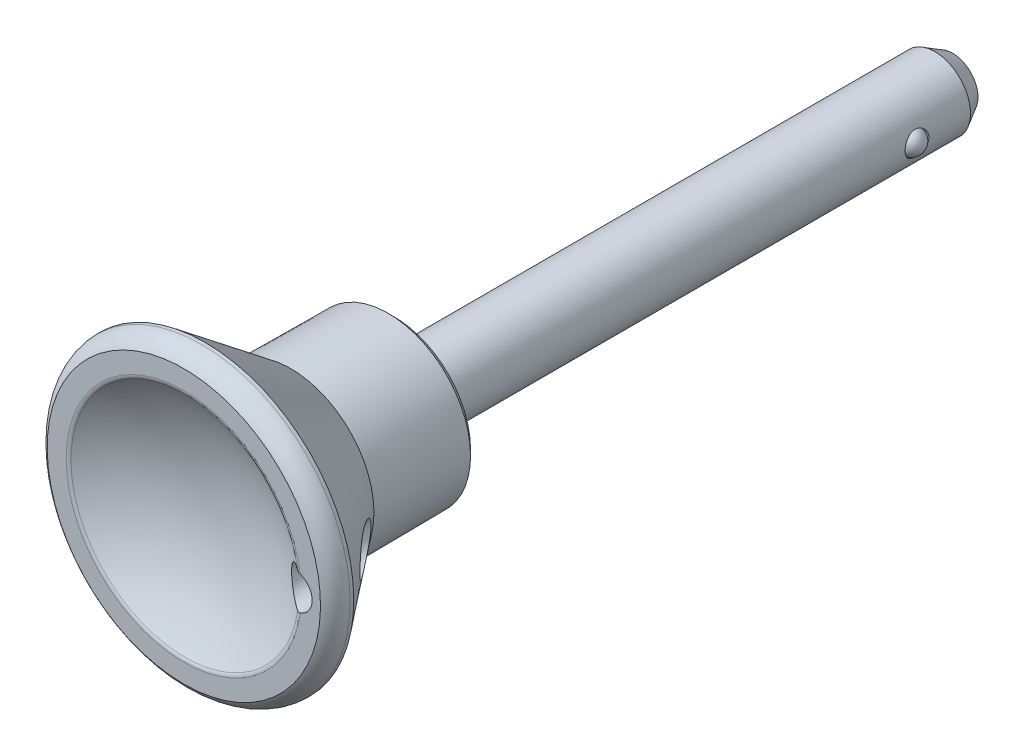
ISO-10303-21;
HEADER;
FILE_DESCRIPTION(('STEP AP214'),'2;1');
FILE_NAME('part.step','',(''),(''),'','','');
FILE_SCHEMA(('AUTOMOTIVE_DESIGN { 1 0 10303 214 1 1 1 1 }'));
ENDSEC;
DATA;
#1=APPLICATION_CONTEXT('core data for automotive mechanical design processes');
#2=APPLICATION_PROTOCOL_DEFINITION('international standard','automotive_design',2000,#1);
#3=PRODUCT_CONTEXT('',#1,'mechanical');
#4=PRODUCT('Part','Part','',(#3));
#5=PRODUCT_RELATED_PRODUCT_CATEGORY('part','',(#4));
#6=PRODUCT_DEFINITION_FORMATION('','',#4);
#7=PRODUCT_DEFINITION_CONTEXT('part definition',#1,'design');
#8=PRODUCT_DEFINITION('design','',#6,#7);
#9=PRODUCT_DEFINITION_SHAPE('','',#8);
#10=(LENGTH_UNIT() NAMED_UNIT(*) SI_UNIT(.MILLI.,.METRE.));
#11=(NAMED_UNIT(*) PLANE_ANGLE_UNIT() SI_UNIT($,.RADIAN.));
#12=(NAMED_UNIT(*) SI_UNIT($,.STERADIAN.) SOLID_ANGLE_UNIT());
#13=UNCERTAINTY_MEASURE_WITH_UNIT(LENGTH_MEASURE(1.E-05),#10,'distance_accuracy_value','');
#14=(GEOMETRIC_REPRESENTATION_CONTEXT(3) GLOBAL_UNCERTAINTY_ASSIGNED_CONTEXT((#13)) GLOBAL_UNIT_ASSIGNED_CONTEXT((#10,
#11,#12)) REPRESENTATION_CONTEXT('',''));
#15=CARTESIAN_POINT('',(0.,0.,0.));
#16=DIRECTION('',(0.,0.,1.));
#17=DIRECTION('',(1.,0.,0.));
#18=AXIS2_PLACEMENT_3D('',#15,#16,#17);
#19=CARTESIAN_POINT('',(0.,0.,0.));
#20=DIRECTION('',(0.,0.,1.));
#21=DIRECTION('',(0.,-1.,0.));
#22=AXIS2_PLACEMENT_3D('',#19,#20,#21);
#23=CYLINDRICAL_SURFACE('',#22,3.);
#24=CARTESIAN_POINT('',(0.,0.,0.));
#25=DIRECTION('',(0.,0.,1.));
#26=DIRECTION('',(0.,-1.,0.));
#27=AXIS2_PLACEMENT_3D('',#24,#25,#26);
#28=CIRCLE('',#27,3.);
#29=CARTESIAN_POINT('',(0.,-3.,0.));
#30=VERTEX_POINT('',#29);
#31=EDGE_CURVE('E17',#30,#30,#28,.T.);
#32=ORIENTED_EDGE('',*,*,#31,.F.);
#33=EDGE_LOOP('',(#32));
#34=FACE_BOUND('',#33,.T.);
#35=CARTESIAN_POINT('',(0.,0.,-45.5));
#36=DIRECTION('',(0.,0.,1.));
#37=DIRECTION('',(1.,0.,0.));
#38=AXIS2_PLACEMENT_3D('',#35,#36,#37);
#39=CIRCLE('',#38,3.);
#40=CARTESIAN_POINT('',(3.,0.,-45.5));
#41=VERTEX_POINT('',#40);
#42=EDGE_CURVE('E106',#41,#41,#39,.T.);
#43=ORIENTED_EDGE('',*,*,#42,.T.);
#44=EDGE_LOOP('',(#43));
#45=FACE_BOUND('',#44,.T.);
#46=CARTESIAN_POINT('',(3.,0.,-42.));
#47=CARTESIAN_POINT('',(2.99999782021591,-0.0544873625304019,-41.9999969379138));
#48=CARTESIAN_POINT('',(2.99849945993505,-0.109030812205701,-41.9955259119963));
#49=CARTESIAN_POINT('',(2.99265949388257,-0.216567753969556,-41.9777925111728));
#50=CARTESIAN_POINT('',(2.98831315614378,-0.269558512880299,-41.9645155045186));
#51=CARTESIAN_POINT('',(2.9772520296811,-0.372338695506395,-41.9296777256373));
#52=CARTESIAN_POINT('',(2.97054267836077,-0.422135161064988,-41.9081359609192));
#53=CARTESIAN_POINT('',(2.95544181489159,-0.517390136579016,-41.8574495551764));
#54=CARTESIAN_POINT('',(2.94705050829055,-0.56284917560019,-41.8283058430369));
#55=CARTESIAN_POINT('',(2.9291411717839,-0.649740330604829,-41.7621750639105));
#56=CARTESIAN_POINT('',(2.91959606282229,-0.691001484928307,-41.7249707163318));
#57=CARTESIAN_POINT('',(2.90060364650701,-0.766830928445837,-41.6442351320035));
#58=CARTESIAN_POINT('',(2.89115636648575,-0.801397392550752,-41.6007021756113));
#59=CARTESIAN_POINT('',(2.87313330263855,-0.863825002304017,-41.5070147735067));
#60=CARTESIAN_POINT('',(2.86459035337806,-0.89146498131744,-41.4567060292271));
#61=CARTESIAN_POINT('',(2.84975302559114,-0.937818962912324,-41.3518236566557));
#62=CARTESIAN_POINT('',(2.84345795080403,-0.956535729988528,-41.2972513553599));
#63=CARTESIAN_POINT('',(2.834113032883,-0.983873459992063,-41.187326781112));
#64=CARTESIAN_POINT('',(2.83096095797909,-0.992813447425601,-41.1320627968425));
#65=CARTESIAN_POINT('',(2.82795656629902,-1.00134112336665,-41.020736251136));
#66=CARTESIAN_POINT('',(2.82810323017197,-1.0009317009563,-40.9646739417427));
#67=CARTESIAN_POINT('',(2.83159014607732,-0.991019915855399,-40.8560634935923));
#68=CARTESIAN_POINT('',(2.83478414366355,-0.981933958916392,-40.8034718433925));
#69=CARTESIAN_POINT('',(2.84376655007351,-0.955606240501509,-40.7006068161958));
#70=CARTESIAN_POINT('',(2.84955528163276,-0.938363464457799,-40.650333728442));
#71=CARTESIAN_POINT('',(2.8631792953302,-0.895938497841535,-40.5525859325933));
#72=CARTESIAN_POINT('',(2.87104608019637,-0.870632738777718,-40.5051694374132));
#73=CARTESIAN_POINT('',(2.88792606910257,-0.812887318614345,-40.4151267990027));
#74=CARTESIAN_POINT('',(2.89693954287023,-0.780445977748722,-40.3725017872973));
#75=CARTESIAN_POINT('',(2.91567165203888,-0.707355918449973,-40.2909155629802));
#76=CARTESIAN_POINT('',(2.92540257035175,-0.666367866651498,-40.2522605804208));
#77=CARTESIAN_POINT('',(2.94406631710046,-0.578354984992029,-40.1822794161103));
#78=CARTESIAN_POINT('',(2.95299879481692,-0.531327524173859,-40.1509564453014));
#79=CARTESIAN_POINT('',(2.96917806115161,-0.431907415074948,-40.0962803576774));
#80=CARTESIAN_POINT('',(2.97640595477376,-0.379463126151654,-40.073015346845));
#81=CARTESIAN_POINT('',(2.98821351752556,-0.27116320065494,-40.0357719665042));
#82=CARTESIAN_POINT('',(2.99279860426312,-0.215314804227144,-40.0217745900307));
#83=CARTESIAN_POINT('',(2.99719039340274,-0.13245787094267,-40.0084544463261));
#84=CARTESIAN_POINT('',(2.99824082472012,-0.106081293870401,-40.0052879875));
#85=CARTESIAN_POINT('',(2.9996461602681,-0.0531409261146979,-40.0010600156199));
#86=CARTESIAN_POINT('',(3.00000106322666,-0.0265771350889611,-39.9999985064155));
#87=CARTESIAN_POINT('',(2.99999782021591,0.0544873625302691,-40.0000030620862));
#88=CARTESIAN_POINT('',(2.99849945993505,0.109030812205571,-40.0044740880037));
#89=CARTESIAN_POINT('',(2.99265949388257,0.216567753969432,-40.0222074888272));
#90=CARTESIAN_POINT('',(2.98831315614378,0.269558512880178,-40.0354844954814));
#91=CARTESIAN_POINT('',(2.9772520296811,0.372338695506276,-40.0703222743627));
#92=CARTESIAN_POINT('',(2.97054267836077,0.422135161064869,-40.0918640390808));
#93=CARTESIAN_POINT('',(2.95544181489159,0.517390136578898,-40.1425504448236));
#94=CARTESIAN_POINT('',(2.94705050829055,0.562849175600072,-40.1716941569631));
#95=CARTESIAN_POINT('',(2.9291411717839,0.64974033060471,-40.2378249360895));
#96=CARTESIAN_POINT('',(2.91959606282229,0.691001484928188,-40.2750292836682));
#97=CARTESIAN_POINT('',(2.90060364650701,0.766830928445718,-40.3557648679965));
#98=CARTESIAN_POINT('',(2.89115636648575,0.801397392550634,-40.3992978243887));
#99=CARTESIAN_POINT('',(2.87313330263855,0.863825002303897,-40.4929852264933));
#100=CARTESIAN_POINT('',(2.86459035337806,0.891464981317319,-40.5432939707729));
#101=CARTESIAN_POINT('',(2.84975302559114,0.937818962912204,-40.6481763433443));
#102=CARTESIAN_POINT('',(2.84345795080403,0.95653572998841,-40.7027486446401));
#103=CARTESIAN_POINT('',(2.834113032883,0.983873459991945,-40.812673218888));
#104=CARTESIAN_POINT('',(2.83096095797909,0.992813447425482,-40.8679372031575));
#105=CARTESIAN_POINT('',(2.82795656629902,1.00134112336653,-40.979263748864));
#106=CARTESIAN_POINT('',(2.82810323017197,1.00093170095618,-41.0353260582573));
#107=CARTESIAN_POINT('',(2.83159014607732,0.991019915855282,-41.1439365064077));
#108=CARTESIAN_POINT('',(2.83478414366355,0.981933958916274,-41.1965281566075));
#109=CARTESIAN_POINT('',(2.84376655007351,0.955606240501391,-41.2993931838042));
#110=CARTESIAN_POINT('',(2.84955528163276,0.938363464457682,-41.349666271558));
#111=CARTESIAN_POINT('',(2.86317929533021,0.895938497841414,-41.4474140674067));
#112=CARTESIAN_POINT('',(2.87104608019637,0.870632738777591,-41.4948305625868));
#113=CARTESIAN_POINT('',(2.88792606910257,0.812887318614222,-41.5848732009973));
#114=CARTESIAN_POINT('',(2.89693954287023,0.780445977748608,-41.6274982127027));
#115=CARTESIAN_POINT('',(2.91567165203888,0.707355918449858,-41.7090844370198));
#116=CARTESIAN_POINT('',(2.92540257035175,0.666367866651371,-41.7477394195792));
#117=CARTESIAN_POINT('',(2.94406631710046,0.578354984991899,-41.8177205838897));
#118=CARTESIAN_POINT('',(2.95299879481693,0.531327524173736,-41.8490435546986));
#119=CARTESIAN_POINT('',(2.96917806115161,0.43190741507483,-41.9037196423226));
#120=CARTESIAN_POINT('',(2.97640595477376,0.379463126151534,-41.926984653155));
#121=CARTESIAN_POINT('',(2.98821351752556,0.271163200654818,-41.9642280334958));
#122=CARTESIAN_POINT('',(2.99279860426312,0.215314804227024,-41.9782254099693));
#123=CARTESIAN_POINT('',(2.99719039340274,0.132457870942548,-41.9915455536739));
#124=CARTESIAN_POINT('',(2.99824082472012,0.106081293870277,-41.9947120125));
#125=CARTESIAN_POINT('',(2.9996461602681,0.0531409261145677,-41.9989399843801));
#126=CARTESIAN_POINT('',(3.00000106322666,0.0265771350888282,-42.0000014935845));
#127=CARTESIAN_POINT('',(3.,0.,-42.));
#128=B_SPLINE_CURVE_WITH_KNOTS('',3,(#46,#47,#48,#49,#50,#51,#52,#53,#54,#55,#56,#57,#58,#59,
#60,#61,#62,#63,#64,#65,#66,#67,#68,#69,#70,#71,#72,#73,#74,#75,#76,#77,#78,#79,#80,#81,#82,#83,
#84,#85,#86,#87,#88,#89,#90,#91,#92,#93,#94,#95,#96,#97,#98,#99,#100,#101,#102,#103,#104,#105,
#106,#107,#108,#109,#110,#111,#112,#113,#114,#115,#116,#117,#118,#119,#120,#121,#122,#123,#124,
#125,#126,#127),.UNSPECIFIED.,.T.,.F.,(4,2,2,2,2,2,2,2,2,2,2,2,2,2,2,2,2,2,2,2,2,2,2,2,2,2,2,2,
2,2,2,2,2,2,2,2,2,2,2,2,4),(0.,0.163359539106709,0.326991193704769,0.490248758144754,
0.653486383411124,0.821842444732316,0.990244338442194,1.16348424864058,1.3366704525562,
1.50401925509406,1.67131634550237,1.8309678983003,1.99063931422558,2.15288605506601,
2.31517103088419,2.48590393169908,2.65671146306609,2.82933165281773,3.00159671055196,
3.08127795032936,3.16095933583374,3.32431887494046,3.48795052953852,3.65120809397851,
3.81444571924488,3.98280178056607,4.15120367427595,4.32444358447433,4.49762978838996,
4.66497859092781,4.83227568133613,4.99192723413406,5.15159865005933,5.31384539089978,
5.47613036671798,5.64686326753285,5.81767079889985,5.9902909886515,6.16255604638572,
6.24223728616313,6.32191867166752),.UNSPECIFIED.);
#129=CARTESIAN_POINT('',(3.,0.,-42.));
#130=VERTEX_POINT('',#129);
#131=EDGE_CURVE('E142',#130,#130,#128,.T.);
#132=ORIENTED_EDGE('',*,*,#131,.T.);
#133=EDGE_LOOP('',(#132));
#134=FACE_BOUND('',#133,.T.);
#135=ADVANCED_FACE('F14',(#34,#45,#134),#23,.T.);
#136=CARTESIAN_POINT('',(6.4240762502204,-6.50116727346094,0.));
#137=DIRECTION('',(0.,0.,-1.));
#138=DIRECTION('',(-1.,0.,0.));
#139=AXIS2_PLACEMENT_3D('',#136,#137,#138);
#140=PLANE('',#139);
#141=ORIENTED_EDGE('',*,*,#31,.T.);
#142=EDGE_LOOP('',(#141));
#143=FACE_BOUND('',#142,.T.);
#144=CARTESIAN_POINT('',(0.,0.,0.));
#145=DIRECTION('',(0.,0.,1.));
#146=DIRECTION('',(0.,-1.,0.));
#147=AXIS2_PLACEMENT_3D('',#144,#145,#146);
#148=CIRCLE('',#147,6.4240762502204);
#149=CARTESIAN_POINT('',(0.,-6.4240762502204,0.));
#150=VERTEX_POINT('',#149);
#151=EDGE_CURVE('E94',#150,#150,#148,.T.);
#152=ORIENTED_EDGE('',*,*,#151,.F.);
#153=EDGE_LOOP('',(#152));
#154=FACE_BOUND('',#153,.T.);
#155=ADVANCED_FACE('F166',(#143,#154),#140,.T.);
#156=CARTESIAN_POINT('',(0.,0.,0.));
#157=DIRECTION('',(0.,0.,1.));
#158=DIRECTION('',(0.,-1.,0.));
#159=AXIS2_PLACEMENT_3D('',#156,#157,#158);
#160=CONICAL_SURFACE('',#159,6.4240762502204,0.789761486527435);
#161=CARTESIAN_POINT('',(0.,0.,0.499980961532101));
#162=DIRECTION('',(0.,0.,-1.));
#163=DIRECTION('',(1.,0.,0.));
#164=AXIS2_PLACEMENT_3D('',#161,#162,#163);
#165=CIRCLE('',#164,6.92843951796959);
#166=CARTESIAN_POINT('',(6.92843951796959,0.,0.499980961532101));
#167=VERTEX_POINT('',#166);
#168=EDGE_CURVE('E123',#167,#167,#165,.F.);
#169=ORIENTED_EDGE('',*,*,#168,.F.);
#170=EDGE_LOOP('',(#169));
#171=FACE_BOUND('',#170,.T.);
#172=ORIENTED_EDGE('',*,*,#151,.T.);
#173=EDGE_LOOP('',(#172));
#174=FACE_BOUND('',#173,.T.);
#175=ADVANCED_FACE('F171',(#171,#174),#160,.T.);
#176=CARTESIAN_POINT('',(0.,0.,0.499980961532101));
#177=DIRECTION('',(0.,0.,1.));
#178=DIRECTION('',(0.,-1.,0.));
#179=AXIS2_PLACEMENT_3D('',#176,#177,#178);
#180=CONICAL_SURFACE('',#179,6.92843951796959,0.00872664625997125);
#181=CARTESIAN_POINT('',(0.,0.,8.7));
#182=DIRECTION('',(0.,0.,-1.));
#183=DIRECTION('',(1.,0.,0.));
#184=AXIS2_PLACEMENT_3D('',#181,#182,#183);
#185=CIRCLE('',#184,7.);
#186=CARTESIAN_POINT('',(7.,0.,8.7));
#187=VERTEX_POINT('',#186);
#188=EDGE_CURVE('E119',#187,#187,#185,.F.);
#189=ORIENTED_EDGE('',*,*,#188,.F.);
#190=EDGE_LOOP('',(#189));
#191=FACE_BOUND('',#190,.T.);
#192=ORIENTED_EDGE('',*,*,#168,.T.);
#193=EDGE_LOOP('',(#192));
#194=FACE_BOUND('',#193,.T.);
#195=ADVANCED_FACE('F180',(#191,#194),#180,.T.);
#196=CARTESIAN_POINT('',(0.,0.,16.2));
#197=DIRECTION('',(0.,0.,1.));
#198=DIRECTION('',(0.,-1.,0.));
#199=AXIS2_PLACEMENT_3D('',#196,#197,#198);
#200=CYLINDRICAL_SURFACE('',#199,12.5);
#201=CARTESIAN_POINT('',(0.,0.,15.9));
#202=DIRECTION('',(0.,0.,-1.));
#203=DIRECTION('',(1.,0.,0.));
#204=AXIS2_PLACEMENT_3D('',#201,#202,#203);
#205=CIRCLE('',#204,12.5);
#206=CARTESIAN_POINT('',(12.5,0.,15.9));
#207=VERTEX_POINT('',#206);
#208=EDGE_CURVE('E120',#207,#207,#205,.T.);
#209=ORIENTED_EDGE('',*,*,#208,.F.);
#210=EDGE_LOOP('',(#209));
#211=FACE_BOUND('',#210,.T.);
#212=CARTESIAN_POINT('',(0.,0.,16.2));
#213=DIRECTION('',(0.,0.,1.));
#214=DIRECTION('',(0.,-1.,0.));
#215=AXIS2_PLACEMENT_3D('',#212,#213,#214);
#216=CIRCLE('',#215,12.5);
#217=CARTESIAN_POINT('',(0.,-12.5,16.2));
#218=VERTEX_POINT('',#217);
#219=EDGE_CURVE('E93',#218,#218,#216,.T.);
#220=ORIENTED_EDGE('',*,*,#219,.F.);
#221=EDGE_LOOP('',(#220));
#222=FACE_BOUND('',#221,.T.);
#223=ADVANCED_FACE('F187',(#211,#222),#200,.T.);
#224=CARTESIAN_POINT('',(0.,0.,8.7));
#225=DIRECTION('',(0.,0.,1.));
#226=DIRECTION('',(0.,-1.,0.));
#227=AXIS2_PLACEMENT_3D('',#224,#225,#226);
#228=CONICAL_SURFACE('',#227,7.,0.65233090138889);
#229=CARTESIAN_POINT('',(9.05806451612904,-1.48036050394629,11.5515077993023));
#230=CARTESIAN_POINT('',(8.99141512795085,-1.46946825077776,11.4631001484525));
#231=CARTESIAN_POINT('',(8.92550148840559,-1.45408557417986,11.3746905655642));
#232=CARTESIAN_POINT('',(8.7955636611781,-1.41427171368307,11.1984472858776));
#233=CARTESIAN_POINT('',(8.73154031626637,-1.38983655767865,11.1106138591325));
#234=CARTESIAN_POINT('',(8.60623315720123,-1.33170423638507,10.936758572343));
#235=CARTESIAN_POINT('',(8.54493725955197,-1.29805393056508,10.8507298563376));
#236=CARTESIAN_POINT('',(8.42544336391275,-1.22074353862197,10.6811358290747));
#237=CARTESIAN_POINT('',(8.36724184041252,-1.17709515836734,10.5975677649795));
#238=CARTESIAN_POINT('',(8.26922940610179,-1.09114708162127,10.4552980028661));
#239=CARTESIAN_POINT('',(8.22852162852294,-1.05135683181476,10.3957022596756));
#240=CARTESIAN_POINT('',(8.14989980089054,-0.964725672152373,10.2796936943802));
#241=CARTESIAN_POINT('',(8.11198828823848,-0.917878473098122,10.2232837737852));
#242=CARTESIAN_POINT('',(8.03963417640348,-0.815744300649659,10.1148327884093));
#243=CARTESIAN_POINT('',(8.00522654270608,-0.760383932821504,10.0628364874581));
#244=CARTESIAN_POINT('',(7.94192848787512,-0.640477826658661,9.96655825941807));
#245=CARTESIAN_POINT('',(7.91302454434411,-0.575955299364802,9.92225744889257));
#246=CARTESIAN_POINT('',(7.87251252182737,-0.463057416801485,9.85986137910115));
#247=CARTESIAN_POINT('',(7.85846623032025,-0.417573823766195,9.8381417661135));
#248=CARTESIAN_POINT('',(7.83441768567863,-0.323152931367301,9.80086955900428));
#249=CARTESIAN_POINT('',(7.82440740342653,-0.274222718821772,9.78530472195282));
#250=CARTESIAN_POINT('',(7.81132335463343,-0.187620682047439,9.76493500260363));
#251=CARTESIAN_POINT('',(7.80710048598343,-0.15053785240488,9.7583503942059));
#252=CARTESIAN_POINT('',(7.80143783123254,-0.0756412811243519,9.74951765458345));
#253=CARTESIAN_POINT('',(7.79999798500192,-0.0378275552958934,9.7472694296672));
#254=CARTESIAN_POINT('',(7.8000025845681,0.0485200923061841,9.74727695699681));
#255=CARTESIAN_POINT('',(7.80237736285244,0.0970629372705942,9.75098545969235));
#256=CARTESIAN_POINT('',(7.81164444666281,0.192651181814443,9.76543406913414));
#257=CARTESIAN_POINT('',(7.81854204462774,0.239694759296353,9.77618241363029));
#258=CARTESIAN_POINT('',(7.83829683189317,0.341610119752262,9.80688772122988));
#259=CARTESIAN_POINT('',(7.85215507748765,0.395817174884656,9.82838678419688));
#260=CARTESIAN_POINT('',(7.8845198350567,0.499375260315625,9.87838349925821));
#261=CARTESIAN_POINT('',(7.90303499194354,0.548717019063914,9.9068941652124));
#262=CARTESIAN_POINT('',(7.95423062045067,0.667068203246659,9.98533549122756));
#263=CARTESIAN_POINT('',(7.98924354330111,0.732796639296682,10.0386516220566));
#264=CARTESIAN_POINT('',(8.06472209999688,0.853932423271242,10.1525776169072));
#265=CARTESIAN_POINT('',(8.10520064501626,0.909314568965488,10.2132047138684));
#266=CARTESIAN_POINT('',(8.18383548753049,1.00367842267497,10.3298982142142));
#267=CARTESIAN_POINT('',(8.22147534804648,1.04387385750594,10.3853483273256));
#268=CARTESIAN_POINT('',(8.29898008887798,1.1184153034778,10.4986148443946));
#269=CARTESIAN_POINT('',(8.33884646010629,1.15275733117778,10.556432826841));
#270=CARTESIAN_POINT('',(8.42042546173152,1.21614962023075,10.6737908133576));
#271=CARTESIAN_POINT('',(8.46214099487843,1.24519116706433,10.7333334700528));
#272=CARTESIAN_POINT('',(8.54706483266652,1.29830522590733,10.8535675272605));
#273=CARTESIAN_POINT('',(8.59027353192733,1.32237641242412,10.9142592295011));
#274=CARTESIAN_POINT('',(8.69675324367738,1.37513054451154,11.0626135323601));
#275=CARTESIAN_POINT('',(8.7606819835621,1.40136483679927,11.150681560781));
#276=CARTESIAN_POINT('',(8.89058399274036,1.44466814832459,11.3275915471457));
#277=CARTESIAN_POINT('',(8.95655819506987,1.46173291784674,11.4164338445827));
#278=CARTESIAN_POINT('',(9.09008194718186,1.48679092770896,11.5942301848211));
#279=CARTESIAN_POINT('',(9.15763151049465,1.49478409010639,11.683184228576));
#280=CARTESIAN_POINT('',(9.293788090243,1.50153429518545,11.8605390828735));
#281=CARTESIAN_POINT('',(9.36239469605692,1.50029483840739,11.9489400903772));
#282=CARTESIAN_POINT('',(9.53896432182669,1.48478544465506,12.1740527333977));
#283=CARTESIAN_POINT('',(9.64741582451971,1.46359594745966,12.3100469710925));
#284=CARTESIAN_POINT('',(9.80896256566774,1.41213790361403,12.5095339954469));
#285=CARTESIAN_POINT('',(9.86259038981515,1.39172486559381,12.5752398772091));
#286=CARTESIAN_POINT('',(9.96902195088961,1.34380635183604,12.7046889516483));
#287=CARTESIAN_POINT('',(10.021826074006,1.31630431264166,12.7684330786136));
#288=CARTESIAN_POINT('',(10.1398540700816,1.24522266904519,12.9099256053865));
#289=CARTESIAN_POINT('',(10.2046458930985,1.1993124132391,12.9868895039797));
#290=CARTESIAN_POINT('',(10.3299573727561,1.09357010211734,13.1345591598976));
#291=CARTESIAN_POINT('',(10.3904821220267,1.03375502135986,13.2052724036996));
#292=CARTESIAN_POINT('',(10.4895745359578,0.916081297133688,13.3202576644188));
#293=CARTESIAN_POINT('',(10.5297805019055,0.861692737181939,13.3666468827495));
#294=CARTESIAN_POINT('',(10.6043536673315,0.743973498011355,13.452316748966));
#295=CARTESIAN_POINT('',(10.6387288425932,0.680655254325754,13.4916071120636));
#296=CARTESIAN_POINT('',(10.6925693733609,0.560424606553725,13.5529446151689));
#297=CARTESIAN_POINT('',(10.7136506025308,0.50520820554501,13.5768833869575));
#298=CARTESIAN_POINT('',(10.7495749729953,0.390302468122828,13.6176027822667));
#299=CARTESIAN_POINT('',(10.7644289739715,0.330621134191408,13.6343958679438));
#300=CARTESIAN_POINT('',(10.7836092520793,0.225596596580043,13.656059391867));
#301=CARTESIAN_POINT('',(10.7897268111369,0.180990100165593,13.6629607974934));
#302=CARTESIAN_POINT('',(10.7979243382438,0.0909301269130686,13.6722061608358));
#303=CARTESIAN_POINT('',(10.8000037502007,0.0454765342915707,13.6745494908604));
#304=CARTESIAN_POINT('',(10.799994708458,-0.0641674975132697,13.6745397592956));
#305=CARTESIAN_POINT('',(10.795841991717,-0.128380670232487,13.6698606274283));
#306=CARTESIAN_POINT('',(10.7796239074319,-0.254506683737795,13.6515601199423));
#307=CARTESIAN_POINT('',(10.7675483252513,-0.31641644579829,13.6379272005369));
#308=CARTESIAN_POINT('',(10.7366563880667,-0.435644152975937,13.6029693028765));
#309=CARTESIAN_POINT('',(10.7178919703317,-0.492993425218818,13.5817035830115));
#310=CARTESIAN_POINT('',(10.6748799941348,-0.602645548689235,13.532811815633));
#311=CARTESIAN_POINT('',(10.6506301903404,-0.654946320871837,13.5051831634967));
#312=CARTESIAN_POINT('',(10.5859735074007,-0.77647271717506,13.4312530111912));
#313=CARTESIAN_POINT('',(10.5432056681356,-0.842728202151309,13.3821425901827));
#314=CARTESIAN_POINT('',(10.4516580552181,-0.964099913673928,13.2763616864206));
#315=CARTESIAN_POINT('',(10.4028645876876,-1.01918998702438,13.2196739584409));
#316=CARTESIAN_POINT('',(10.2766029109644,-1.1434550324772,13.0719673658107));
#317=CARTESIAN_POINT('',(10.1967753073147,-1.20635475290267,12.9777102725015));
#318=CARTESIAN_POINT('',(10.0329696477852,-1.31236147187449,12.7820645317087));
#319=CARTESIAN_POINT('',(9.94898466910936,-1.35543413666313,12.6806638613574));
#320=CARTESIAN_POINT('',(9.79718248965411,-1.41705079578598,12.4951419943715));
#321=CARTESIAN_POINT('',(9.72964852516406,-1.43883766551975,12.4118303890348));
#322=CARTESIAN_POINT('',(9.59439459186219,-1.47247845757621,12.2433068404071));
#323=CARTESIAN_POINT('',(9.52667453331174,-1.48432617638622,12.1580937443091));
#324=CARTESIAN_POINT('',(9.39151350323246,-1.49875216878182,11.9862568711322));
#325=CARTESIAN_POINT('',(9.32407407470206,-1.50130123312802,11.8996295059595));
#326=CARTESIAN_POINT('',(9.19020636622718,-1.49747387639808,11.7258378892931));
#327=CARTESIAN_POINT('',(9.12377782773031,-1.49109977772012,11.6386737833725));
#328=CARTESIAN_POINT('',(9.05806451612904,-1.48036050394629,11.5515077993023));
#329=B_SPLINE_CURVE_WITH_KNOTS('',3,(#229,#230,#231,#232,#233,#234,#235,#236,#237,#238,#239,
#240,#241,#242,#243,#244,#245,#246,#247,#248,#249,#250,#251,#252,#253,#254,#255,#256,#257,#258,
#259,#260,#261,#262,#263,#264,#265,#266,#267,#268,#269,#270,#271,#272,#273,#274,#275,#276,#277,
#278,#279,#280,#281,#282,#283,#284,#285,#286,#287,#288,#289,#290,#291,#292,#293,#294,#295,#296,
#297,#298,#299,#300,#301,#302,#303,#304,#305,#306,#307,#308,#309,#310,#311,#312,#313,#314,#315,
#316,#317,#318,#319,#320,#321,#322,#323,#324,#325,#326,#327,#328),.UNSPECIFIED.,.T.,.F.,(4,2,2,
2,2,2,2,2,2,2,2,2,2,2,2,2,2,2,2,2,2,2,2,2,2,2,2,2,2,2,2,2,2,2,2,2,2,2,2,2,2,2,2,2,2,2,2,2,2,4),
(0.,0.333658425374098,0.667463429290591,0.999601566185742,1.33135280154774,1.57826788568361,
1.82540433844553,2.07480511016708,2.32358497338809,2.48005639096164,2.63621497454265,
2.74958301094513,2.86294859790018,3.00835870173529,3.15393926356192,3.33275537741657,
3.51190592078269,3.78514778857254,4.05904679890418,4.2931693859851,4.52745067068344,
4.76211373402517,4.9968392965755,5.33221840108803,5.66775280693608,6.0032900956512,
6.33870017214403,6.86226215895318,7.12372139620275,7.38505412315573,7.71589293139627,
8.04632996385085,8.29159071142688,8.53651321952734,8.72709088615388,8.91733480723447,
9.0535973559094,9.18987866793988,9.38217192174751,9.57471358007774,9.76579164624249,
9.95694806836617,10.2340958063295,10.5118854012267,10.9254412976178,11.3397106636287,
11.6675345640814,11.995562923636,12.3246208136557,12.6535930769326),.UNSPECIFIED.);
#330=CARTESIAN_POINT('',(9.05806451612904,-1.48036050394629,11.5515077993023));
#331=VERTEX_POINT('',#330);
#332=EDGE_CURVE('E49',#331,#331,#329,.T.);
#333=ORIENTED_EDGE('',*,*,#332,.F.);
#334=EDGE_LOOP('',(#333));
#335=FACE_BOUND('',#334,.T.);
#336=ORIENTED_EDGE('',*,*,#208,.T.);
#337=EDGE_LOOP('',(#336));
#338=FACE_BOUND('',#337,.T.);
#339=ORIENTED_EDGE('',*,*,#188,.T.);
#340=EDGE_LOOP('',(#339));
#341=FACE_BOUND('',#340,.T.);
#342=ADVANCED_FACE('F190',(#335,#338,#341),#228,.T.);
#343=CARTESIAN_POINT('',(0.,0.,15.9596620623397));
#344=DIRECTION('',(0.,0.,1.));
#345=DIRECTION('',(0.,-1.,0.));
#346=AXIS2_PLACEMENT_3D('',#343,#344,#345);
#347=TOROIDAL_SURFACE('',#346,10.5144930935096,2.);
#348=ORIENTED_EDGE('',*,*,#219,.T.);
#349=EDGE_LOOP('',(#348));
#350=FACE_BOUND('',#349,.T.);
#351=CARTESIAN_POINT('',(0.,0.,17.7));
#352=DIRECTION('',(0.,0.,1.));
#353=DIRECTION('',(0.,-1.,0.));
#354=AXIS2_PLACEMENT_3D('',#351,#352,#353);
#355=CIRCLE('',#354,11.5);
#356=CARTESIAN_POINT('',(0.,-11.5,17.7));
#357=VERTEX_POINT('',#356);
#358=EDGE_CURVE('E53',#357,#357,#355,.T.);
#359=ORIENTED_EDGE('',*,*,#358,.F.);
#360=EDGE_LOOP('',(#359));
#361=FACE_BOUND('',#360,.T.);
#362=ADVANCED_FACE('F78',(#350,#361),#347,.T.);
#363=CARTESIAN_POINT('',(9.3,0.,9.74688245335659));
#364=DIRECTION('',(0.,0.,1.));
#365=DIRECTION('',(0.,-1.,0.));
#366=AXIS2_PLACEMENT_3D('',#363,#364,#365);
#367=CYLINDRICAL_SURFACE('',#366,1.5);
#368=ORIENTED_EDGE('',*,*,#332,.T.);
#369=EDGE_LOOP('',(#368));
#370=FACE_BOUND('',#369,.T.);
#371=CARTESIAN_POINT('',(9.79838709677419,-1.41478277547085,17.7));
#372=CARTESIAN_POINT('',(9.76967463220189,-1.42493393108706,17.7000278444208));
#373=CARTESIAN_POINT('',(9.74057958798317,-1.43416331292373,17.6978154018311));
#374=CARTESIAN_POINT('',(9.68339626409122,-1.45046247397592,17.688811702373));
#375=CARTESIAN_POINT('',(9.65530246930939,-1.45758512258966,17.6821493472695));
#376=CARTESIAN_POINT('',(9.60265119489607,-1.46937623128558,17.6649718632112));
#377=CARTESIAN_POINT('',(9.5780018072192,-1.47420693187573,17.6548534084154));
#378=CARTESIAN_POINT('',(9.52973678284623,-1.48251466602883,17.6305344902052));
#379=CARTESIAN_POINT('',(9.50616459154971,-1.48595330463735,17.6162348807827));
#380=CARTESIAN_POINT('',(9.48387096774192,-1.48868783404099,17.6));
#381=B_SPLINE_CURVE_WITH_KNOTS('',3,(#371,#372,#373,#374,#375,#376,#377,#378,#379,#380),
.UNSPECIFIED.,.F.,.F.,(4,2,2,2,4),(0.,0.0913475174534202,0.180157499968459,0.261045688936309,
0.344033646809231),.UNSPECIFIED.);
#382=CARTESIAN_POINT('',(9.79838709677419,-1.41478277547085,17.7));
#383=VERTEX_POINT('',#382);
#384=CARTESIAN_POINT('',(9.48387096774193,-1.48868783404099,17.6));
#385=VERTEX_POINT('',#384);
#386=EDGE_CURVE('E42',#383,#385,#381,.T.);
#387=ORIENTED_EDGE('',*,*,#386,.F.);
#388=CARTESIAN_POINT('',(9.3,0.,17.7));
#389=DIRECTION('',(0.,0.,1.));
#390=DIRECTION('',(0.,-1.,0.));
#391=AXIS2_PLACEMENT_3D('',#388,#389,#390);
#392=CIRCLE('',#391,1.5);
#393=CARTESIAN_POINT('',(9.79838709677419,1.41478277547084,17.7));
#394=VERTEX_POINT('',#393);
#395=EDGE_CURVE('E30',#394,#383,#392,.F.);
#396=ORIENTED_EDGE('',*,*,#395,.F.);
#397=CARTESIAN_POINT('',(9.79838709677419,1.41478277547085,17.7));
#398=CARTESIAN_POINT('',(9.76967463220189,1.42493393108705,17.7000278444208));
#399=CARTESIAN_POINT('',(9.74057958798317,1.43416331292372,17.6978154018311));
#400=CARTESIAN_POINT('',(9.68339626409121,1.45046247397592,17.688811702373));
#401=CARTESIAN_POINT('',(9.65530246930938,1.45758512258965,17.6821493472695));
#402=CARTESIAN_POINT('',(9.60265119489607,1.46937623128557,17.6649718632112));
#403=CARTESIAN_POINT('',(9.57800180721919,1.47420693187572,17.6548534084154));
#404=CARTESIAN_POINT('',(9.52973678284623,1.48251466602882,17.6305344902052));
#405=CARTESIAN_POINT('',(9.50616459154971,1.48595330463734,17.6162348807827));
#406=CARTESIAN_POINT('',(9.48387096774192,1.48868783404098,17.6));
#407=B_SPLINE_CURVE_WITH_KNOTS('',3,(#397,#398,#399,#400,#401,#402,#403,#404,#405,#406),
.UNSPECIFIED.,.F.,.F.,(4,2,2,2,4),(0.,0.0913475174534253,0.180157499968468,0.261045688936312,
0.344033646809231),.UNSPECIFIED.);
#408=CARTESIAN_POINT('',(9.48387096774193,1.48868783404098,17.6));
#409=VERTEX_POINT('',#408);
#410=EDGE_CURVE('E43',#394,#409,#407,.T.);
#411=ORIENTED_EDGE('',*,*,#410,.T.);
#412=CARTESIAN_POINT('',(9.48387096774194,-1.48868783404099,17.6));
#413=CARTESIAN_POINT('',(9.38181447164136,-1.5012604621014,17.5258231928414));
#414=CARTESIAN_POINT('',(9.27847034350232,-1.50339409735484,17.4514075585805));
#415=CARTESIAN_POINT('',(9.07150168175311,-1.48616897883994,17.3036113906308));
#416=CARTESIAN_POINT('',(8.96788247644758,-1.46662385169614,17.230245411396));
#417=CARTESIAN_POINT('',(8.76570217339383,-1.40554015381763,17.0882393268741));
#418=CARTESIAN_POINT('',(8.66709675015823,-1.36425592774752,17.0195547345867));
#419=CARTESIAN_POINT('',(8.47807170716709,-1.25938003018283,16.8888158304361));
#420=CARTESIAN_POINT('',(8.38761877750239,-1.19588484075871,16.8267343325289));
#421=CARTESIAN_POINT('',(8.24568836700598,-1.0697955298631,16.7298945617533));
#422=CARTESIAN_POINT('',(8.19079097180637,-1.01295594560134,16.692612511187));
#423=CARTESIAN_POINT('',(8.08925811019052,-0.889102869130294,16.6238983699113));
#424=CARTESIAN_POINT('',(8.04262373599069,-0.822088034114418,16.5924670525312));
#425=CARTESIAN_POINT('',(7.95961243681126,-0.678453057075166,16.5366671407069));
#426=CARTESIAN_POINT('',(7.92332116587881,-0.601759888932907,16.5123574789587));
#427=CARTESIAN_POINT('',(7.86387797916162,-0.44138513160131,16.4726071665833));
#428=CARTESIAN_POINT('',(7.84069382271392,-0.357721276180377,16.4571447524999));
#429=CARTESIAN_POINT('',(7.81665644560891,-0.227526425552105,16.4411240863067));
#430=CARTESIAN_POINT('',(7.81042627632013,-0.182354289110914,16.436974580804));
#431=CARTESIAN_POINT('',(7.80209606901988,-0.0914654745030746,16.4314273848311));
#432=CARTESIAN_POINT('',(7.79999581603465,-0.0457488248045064,16.4300295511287));
#433=CARTESIAN_POINT('',(7.8000067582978,0.0738974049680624,16.4300365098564));
#434=CARTESIAN_POINT('',(7.80550430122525,0.147878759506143,16.4336949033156));
#435=CARTESIAN_POINT('',(7.82172596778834,0.257047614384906,16.4445026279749));
#436=CARTESIAN_POINT('',(7.82847272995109,0.293170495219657,16.4489987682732));
#437=CARTESIAN_POINT('',(7.84452794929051,0.364609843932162,16.4597055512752));
#438=CARTESIAN_POINT('',(7.85383787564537,0.399925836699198,16.4659171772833));
#439=CARTESIAN_POINT('',(7.88533418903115,0.503926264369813,16.4869492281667));
#440=CARTESIAN_POINT('',(7.91114789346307,0.571060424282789,16.5042071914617));
#441=CARTESIAN_POINT('',(7.97122958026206,0.699580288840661,16.5444764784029));
#442=CARTESIAN_POINT('',(8.00550445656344,0.760961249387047,16.5674924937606));
#443=CARTESIAN_POINT('',(8.06330229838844,0.849663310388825,16.6064232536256));
#444=CARTESIAN_POINT('',(8.08431449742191,0.879441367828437,16.6205962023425));
#445=CARTESIAN_POINT('',(8.12808579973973,0.936974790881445,16.6501700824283));
#446=CARTESIAN_POINT('',(8.15084283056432,0.964732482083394,16.6655695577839));
#447=CARTESIAN_POINT('',(8.22150377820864,1.04495101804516,16.7134720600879));
#448=CARTESIAN_POINT('',(8.27178709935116,1.09434151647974,16.7476721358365));
#449=CARTESIAN_POINT('',(8.38550726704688,1.19170689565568,16.8253434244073));
#450=CARTESIAN_POINT('',(8.44976642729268,1.2382209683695,16.8694253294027));
#451=CARTESIAN_POINT('',(8.58287694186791,1.31978473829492,16.961227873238));
#452=CARTESIAN_POINT('',(8.65173257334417,1.3548235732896,17.0089519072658));
#453=CARTESIAN_POINT('',(8.76337185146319,1.40144242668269,17.0867690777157));
#454=CARTESIAN_POINT('',(8.80522580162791,1.41674274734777,17.1160369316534));
#455=CARTESIAN_POINT('',(8.88962205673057,1.44344948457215,17.1752539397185));
#456=CARTESIAN_POINT('',(8.93216367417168,1.45485956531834,17.2052024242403));
#457=CARTESIAN_POINT('',(9.06048356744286,1.4833442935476,17.2958544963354));
#458=CARTESIAN_POINT('',(9.14699642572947,1.4946896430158,17.3573922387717));
#459=CARTESIAN_POINT('',(9.31725275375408,1.50223877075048,17.4793658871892));
#460=CARTESIAN_POINT('',(9.40099551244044,1.49891929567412,17.5397732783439));
#461=CARTESIAN_POINT('',(9.48387096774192,1.4886878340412,17.6));
#462=B_SPLINE_CURVE_WITH_KNOTS('',3,(#412,#413,#414,#415,#416,#417,#418,#419,#420,#421,#422,
#423,#424,#425,#426,#427,#428,#429,#430,#431,#432,#433,#434,#435,#436,#437,#438,#439,#440,#441,
#442,#443,#444,#445,#446,#447,#448,#449,#450,#451,#452,#453,#454,#455,#456,#457,#458,#459,#460,
#461),.UNSPECIFIED.,.F.,.F.,(4,2,2,2,2,2,2,2,2,2,2,2,2,2,2,2,2,2,2,2,2,2,2,2,4),(0.,
0.380173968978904,0.763641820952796,1.14271969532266,1.52017093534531,1.7812816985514,
2.04242694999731,2.3056758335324,2.56827433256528,2.70539664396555,2.84251181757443,
3.06399194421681,3.17494513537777,3.28596205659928,3.50680011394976,3.72781870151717,
3.8450322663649,3.96210870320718,4.19632161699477,4.46759731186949,4.73912905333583,
4.89893578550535,5.05859157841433,5.37775215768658,5.6866146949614),.UNSPECIFIED.);
#463=EDGE_CURVE('E48',#385,#409,#462,.T.);
#464=ORIENTED_EDGE('',*,*,#463,.F.);
#465=EDGE_LOOP('',(#387,#396,#411,#464));
#466=FACE_BOUND('',#465,.T.);
#467=ADVANCED_FACE('F46',(#370,#466),#367,.F.);
#468=CARTESIAN_POINT('',(0.,0.,30.4));
#469=DIRECTION('',(0.,-1.,0.));
#470=DIRECTION('',(0.,0.,1.));
#471=AXIS2_PLACEMENT_3D('',#468,#469,#470);
#472=SPHERICAL_SURFACE('',#471,16.);
#473=ORIENTED_EDGE('',*,*,#463,.T.);
#474=CARTESIAN_POINT('',(0.,0.,17.6));
#475=DIRECTION('',(0.,0.,1.));
#476=DIRECTION('',(0.,-1.,0.));
#477=AXIS2_PLACEMENT_3D('',#474,#475,#476);
#478=CIRCLE('',#477,9.6);
#479=EDGE_CURVE('E23',#385,#409,#478,.F.);
#480=ORIENTED_EDGE('',*,*,#479,.F.);
#481=EDGE_LOOP('',(#473,#480));
#482=FACE_BOUND('',#481,.T.);
#483=ADVANCED_FACE('F71',(#482),#472,.F.);
#484=CARTESIAN_POINT('',(-11.73,-11.4999999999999,17.7));
#485=CARTESIAN_POINT('',(-11.5,-11.4999999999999,17.7));
#486=CARTESIAN_POINT('',(11.5,-11.4999999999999,17.7));
#487=B_SPLINE_CURVE_WITH_KNOTS('',1,(#484,#485,#486),.UNSPECIFIED.,.F.,.F.,(2,1,2),(-0.01,0.,
1.),.UNSPECIFIED.);
#488=DIRECTION('',(0.,1.,0.));
#489=VECTOR('',#488,1.);
#490=SURFACE_OF_LINEAR_EXTRUSION('',#487,#489);
#491=ORIENTED_EDGE('',*,*,#395,.T.);
#492=CARTESIAN_POINT('',(0.,0.,17.7));
#493=DIRECTION('',(0.,0.,1.));
#494=DIRECTION('',(0.,-1.,0.));
#495=AXIS2_PLACEMENT_3D('',#492,#493,#494);
#496=CIRCLE('',#495,9.9);
#497=EDGE_CURVE('E9',#394,#383,#496,.T.);
#498=ORIENTED_EDGE('',*,*,#497,.F.);
#499=EDGE_LOOP('',(#491,#498));
#500=FACE_BOUND('',#499,.T.);
#501=ORIENTED_EDGE('',*,*,#358,.T.);
#502=EDGE_LOOP('',(#501));
#503=FACE_BOUND('',#502,.T.);
#504=ADVANCED_FACE('F51',(#500,#503),#490,.T.);
#505=CARTESIAN_POINT('',(0.,0.,17.2));
#506=DIRECTION('',(0.,0.,1.));
#507=DIRECTION('',(0.,-1.,0.));
#508=AXIS2_PLACEMENT_3D('',#505,#506,#507);
#509=TOROIDAL_SURFACE('',#508,9.89999999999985,0.50000000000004);
#510=ORIENTED_EDGE('',*,*,#410,.F.);
#511=ORIENTED_EDGE('',*,*,#497,.T.);
#512=ORIENTED_EDGE('',*,*,#386,.T.);
#513=ORIENTED_EDGE('',*,*,#479,.T.);
#514=EDGE_LOOP('',(#510,#511,#512,#513));
#515=FACE_BOUND('',#514,.T.);
#516=ADVANCED_FACE('F40',(#515),#509,.T.);
#517=CARTESIAN_POINT('',(2.49,0.,-41.));
#518=DIRECTION('',(0.,-1.,0.));
#519=DIRECTION('',(0.,0.,-1.));
#520=AXIS2_PLACEMENT_3D('',#517,#518,#519);
#521=SPHERICAL_SURFACE('',#520,1.01);
#522=CARTESIAN_POINT('',(2.63177446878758,0.,-41.));
#523=DIRECTION('',(1.,0.,0.));
#524=DIRECTION('',(0.,-1.,0.));
#525=AXIS2_PLACEMENT_3D('',#522,#523,#524);
#526=CIRCLE('',#525,1.);
#527=CARTESIAN_POINT('',(2.63177446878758,-1.00000000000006,-41.));
#528=VERTEX_POINT('',#527);
#529=EDGE_CURVE('E133',#528,#528,#526,.F.);
#530=ORIENTED_EDGE('',*,*,#529,.F.);
#531=EDGE_LOOP('',(#530));
#532=FACE_BOUND('',#531,.T.);
#533=ADVANCED_FACE('F99',(#532),#521,.T.);
#534=CARTESIAN_POINT('',(2.13397459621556,-2.15958441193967,-47.));
#535=DIRECTION('',(0.,0.,-1.));
#536=DIRECTION('',(-1.,0.,0.));
#537=AXIS2_PLACEMENT_3D('',#534,#535,#536);
#538=PLANE('',#537);
#539=CARTESIAN_POINT('',(0.,0.,-47.));
#540=DIRECTION('',(0.,0.,1.));
#541=DIRECTION('',(0.,-1.,0.));
#542=AXIS2_PLACEMENT_3D('',#539,#540,#541);
#543=CIRCLE('',#542,2.13397459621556);
#544=CARTESIAN_POINT('',(0.,-2.13397459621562,-47.));
#545=VERTEX_POINT('',#544);
#546=EDGE_CURVE('E137',#545,#545,#543,.T.);
#547=ORIENTED_EDGE('',*,*,#546,.F.);
#548=EDGE_LOOP('',(#547));
#549=FACE_BOUND('',#548,.T.);
#550=ADVANCED_FACE('F156',(#549),#538,.T.);
#551=CARTESIAN_POINT('',(2.63177446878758,0.,-41.));
#552=DIRECTION('',(1.,0.,0.));
#553=DIRECTION('',(0.,-1.,0.));
#554=AXIS2_PLACEMENT_3D('',#551,#552,#553);
#555=CYLINDRICAL_SURFACE('',#554,1.);
#556=ORIENTED_EDGE('',*,*,#529,.T.);
#557=EDGE_LOOP('',(#556));
#558=FACE_BOUND('',#557,.T.);
#559=ORIENTED_EDGE('',*,*,#131,.F.);
#560=EDGE_LOOP('',(#559));
#561=FACE_BOUND('',#560,.T.);
#562=ADVANCED_FACE('F151',(#558,#561),#555,.F.);
#563=CARTESIAN_POINT('',(0.,0.,-47.));
#564=DIRECTION('',(0.,0.,1.));
#565=DIRECTION('',(0.,-1.,0.));
#566=AXIS2_PLACEMENT_3D('',#563,#564,#565);
#567=CONICAL_SURFACE('',#566,2.13397459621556,0.523598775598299);
#568=ORIENTED_EDGE('',*,*,#42,.F.);
#569=EDGE_LOOP('',(#568));
#570=FACE_BOUND('',#569,.T.);
#571=ORIENTED_EDGE('',*,*,#546,.T.);
#572=EDGE_LOOP('',(#571));
#573=FACE_BOUND('',#572,.T.);
#574=ADVANCED_FACE('F155',(#570,#573),#567,.T.);
#575=CLOSED_SHELL('',(#135,#155,#175,#195,#223,#342,#362,#467,#483,#504,#516,#533,#550,#562,#574));
#576=MANIFOLD_SOLID_BREP('B1',#575);
#577=ADVANCED_BREP_SHAPE_REPRESENTATION('',(#18,#576),#14);
#578=SHAPE_DEFINITION_REPRESENTATION(#9,#577);
ENDSEC;
END-ISO-10303-21;
